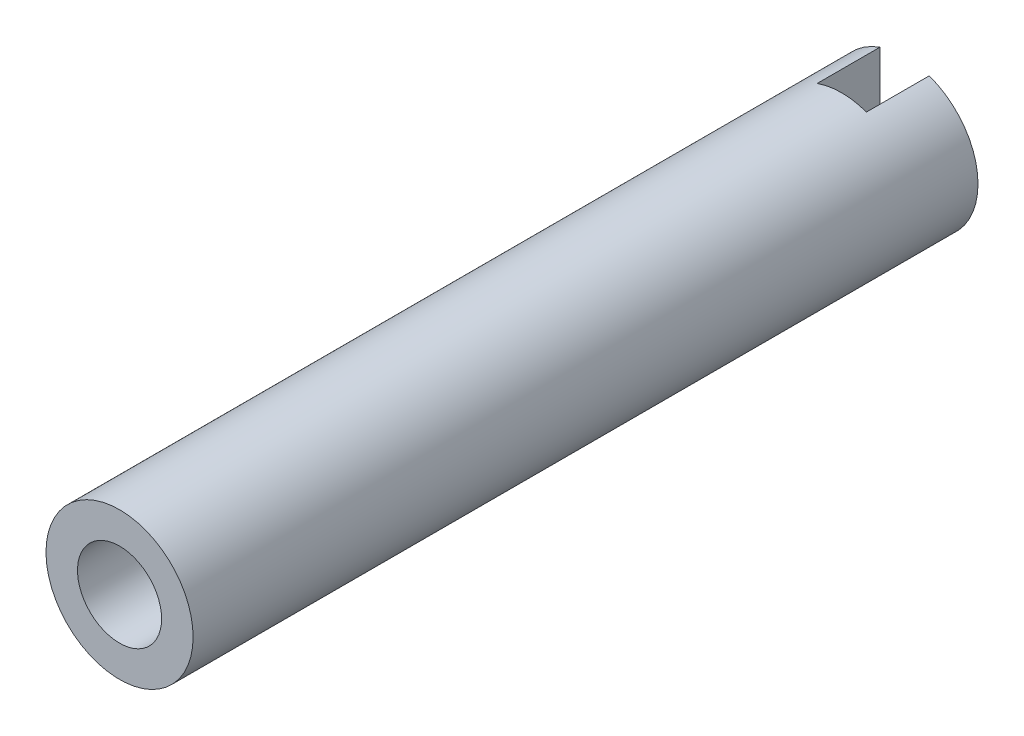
ISO-10303-21;
HEADER;
FILE_DESCRIPTION(('STEP AP214'),'2;1');
FILE_NAME('part.step','',(''),(''),'','','');
FILE_SCHEMA(('AUTOMOTIVE_DESIGN { 1 0 10303 214 1 1 1 1 }'));
ENDSEC;
DATA;
#1=APPLICATION_CONTEXT('core data for automotive mechanical design processes');
#2=APPLICATION_PROTOCOL_DEFINITION('international standard','automotive_design',2000,#1);
#3=PRODUCT_CONTEXT('',#1,'mechanical');
#4=PRODUCT('Part','Part','',(#3));
#5=PRODUCT_RELATED_PRODUCT_CATEGORY('part','',(#4));
#6=PRODUCT_DEFINITION_FORMATION('','',#4);
#7=PRODUCT_DEFINITION_CONTEXT('part definition',#1,'design');
#8=PRODUCT_DEFINITION('design','',#6,#7);
#9=PRODUCT_DEFINITION_SHAPE('','',#8);
#10=(LENGTH_UNIT() NAMED_UNIT(*) SI_UNIT(.MILLI.,.METRE.));
#11=(NAMED_UNIT(*) PLANE_ANGLE_UNIT() SI_UNIT($,.RADIAN.));
#12=(NAMED_UNIT(*) SI_UNIT($,.STERADIAN.) SOLID_ANGLE_UNIT());
#13=UNCERTAINTY_MEASURE_WITH_UNIT(LENGTH_MEASURE(1.E-05),#10,'distance_accuracy_value','');
#14=(GEOMETRIC_REPRESENTATION_CONTEXT(3) GLOBAL_UNCERTAINTY_ASSIGNED_CONTEXT((#13)) GLOBAL_UNIT_ASSIGNED_CONTEXT((#10,
#11,#12)) REPRESENTATION_CONTEXT('',''));
#15=CARTESIAN_POINT('',(0.,0.,0.));
#16=DIRECTION('',(0.,0.,1.));
#17=DIRECTION('',(1.,0.,0.));
#18=AXIS2_PLACEMENT_3D('',#15,#16,#17);
#19=CARTESIAN_POINT('',(0.,0.,0.));
#20=DIRECTION('',(0.,0.,1.));
#21=DIRECTION('',(1.,0.,0.));
#22=AXIS2_PLACEMENT_3D('',#19,#20,#21);
#23=PLANE('',#22);
#24=CARTESIAN_POINT('',(0.,0.,0.));
#25=DIRECTION('',(0.,0.,1.));
#26=DIRECTION('',(1.,0.,0.));
#27=AXIS2_PLACEMENT_3D('',#24,#25,#26);
#28=CIRCLE('',#27,2.0828);
#29=CARTESIAN_POINT('',(-0.694236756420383,1.96369324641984,0.));
#30=VERTEX_POINT('',#29);
#31=CARTESIAN_POINT('',(-0.694236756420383,-1.96369324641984,0.));
#32=VERTEX_POINT('',#31);
#33=EDGE_CURVE('E117',#30,#32,#28,.T.);
#34=ORIENTED_EDGE('',*,*,#33,.F.);
#35=DIRECTION('',(0.,-1.,0.));
#36=VECTOR('',#35,1.);
#37=CARTESIAN_POINT('',(-0.694236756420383,0.,0.));
#38=LINE('',#37,#36);
#39=EDGE_CURVE('E128',#30,#32,#38,.T.);
#40=ORIENTED_EDGE('',*,*,#39,.T.);
#41=EDGE_LOOP('',(#34,#40));
#42=FACE_BOUND('',#41,.T.);
#43=ADVANCED_FACE('F38',(#42),#23,.F.);
#44=CARTESIAN_POINT('',(0.,0.,22.225));
#45=DIRECTION('',(0.,0.,-1.));
#46=DIRECTION('',(-1.,0.,0.));
#47=AXIS2_PLACEMENT_3D('',#44,#45,#46);
#48=CYLINDRICAL_SURFACE('',#47,2.0828);
#49=CARTESIAN_POINT('',(0.,0.,1.778));
#50=DIRECTION('',(0.,0.,1.));
#51=DIRECTION('',(1.,0.,0.));
#52=AXIS2_PLACEMENT_3D('',#49,#50,#51);
#53=CIRCLE('',#52,2.0828);
#54=CARTESIAN_POINT('',(0.702763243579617,1.96065796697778,1.778));
#55=VERTEX_POINT('',#54);
#56=CARTESIAN_POINT('',(-0.694236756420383,1.96369324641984,1.778));
#57=VERTEX_POINT('',#56);
#58=EDGE_CURVE('E48',#55,#57,#53,.T.);
#59=ORIENTED_EDGE('',*,*,#58,.T.);
#60=DIRECTION('',(0.,0.,-1.));
#61=VECTOR('',#60,1.);
#62=CARTESIAN_POINT('',(-0.694236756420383,1.96369324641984,22.225));
#63=LINE('',#62,#61);
#64=EDGE_CURVE('E118',#57,#30,#63,.T.);
#65=ORIENTED_EDGE('',*,*,#64,.T.);
#66=ORIENTED_EDGE('',*,*,#33,.T.);
#67=DIRECTION('',(0.,0.,-1.));
#68=VECTOR('',#67,1.);
#69=CARTESIAN_POINT('',(-0.694236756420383,-1.96369324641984,22.225));
#70=LINE('',#69,#68);
#71=CARTESIAN_POINT('',(-0.694236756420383,-1.96369324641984,1.778));
#72=VERTEX_POINT('',#71);
#73=EDGE_CURVE('E123',#32,#72,#70,.F.);
#74=ORIENTED_EDGE('',*,*,#73,.T.);
#75=CARTESIAN_POINT('',(0.702763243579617,-1.96065796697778,1.778));
#76=VERTEX_POINT('',#75);
#77=EDGE_CURVE('E130',#72,#76,#53,.T.);
#78=ORIENTED_EDGE('',*,*,#77,.T.);
#79=DIRECTION('',(0.,0.,-1.));
#80=VECTOR('',#79,1.);
#81=CARTESIAN_POINT('',(0.702763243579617,-1.96065796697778,22.225));
#82=LINE('',#81,#80);
#83=CARTESIAN_POINT('',(0.702763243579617,-1.96065796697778,0.));
#84=VERTEX_POINT('',#83);
#85=EDGE_CURVE('E140',#76,#84,#82,.T.);
#86=ORIENTED_EDGE('',*,*,#85,.T.);
#87=CARTESIAN_POINT('',(0.702763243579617,1.96065796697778,0.));
#88=VERTEX_POINT('',#87);
#89=EDGE_CURVE('E116',#84,#88,#28,.T.);
#90=ORIENTED_EDGE('',*,*,#89,.T.);
#91=DIRECTION('',(0.,0.,-1.));
#92=VECTOR('',#91,1.);
#93=CARTESIAN_POINT('',(0.702763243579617,1.96065796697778,22.225));
#94=LINE('',#93,#92);
#95=EDGE_CURVE('E55',#88,#55,#94,.F.);
#96=ORIENTED_EDGE('',*,*,#95,.T.);
#97=EDGE_LOOP('',(#59,#65,#66,#74,#78,#86,#90,#96));
#98=FACE_BOUND('',#97,.T.);
#99=CARTESIAN_POINT('',(0.,0.,22.225));
#100=DIRECTION('',(0.,0.,1.));
#101=DIRECTION('',(1.,0.,0.));
#102=AXIS2_PLACEMENT_3D('',#99,#100,#101);
#103=CIRCLE('',#102,2.0828);
#104=CARTESIAN_POINT('',(2.0828,0.,22.225));
#105=VERTEX_POINT('',#104);
#106=EDGE_CURVE('E121',#105,#105,#103,.T.);
#107=ORIENTED_EDGE('',*,*,#106,.F.);
#108=EDGE_LOOP('',(#107));
#109=FACE_BOUND('',#108,.T.);
#110=ADVANCED_FACE('F92',(#98,#109),#48,.T.);
#111=CARTESIAN_POINT('',(0.,0.,22.225));
#112=DIRECTION('',(0.,0.,1.));
#113=DIRECTION('',(1.,0.,0.));
#114=AXIS2_PLACEMENT_3D('',#111,#112,#113);
#115=PLANE('',#114);
#116=CARTESIAN_POINT('',(0.,0.,22.225));
#117=DIRECTION('',(0.,0.,1.));
#118=DIRECTION('',(1.,0.,0.));
#119=AXIS2_PLACEMENT_3D('',#116,#117,#118);
#120=CIRCLE('',#119,1.190625);
#121=CARTESIAN_POINT('',(1.190625,0.,22.225));
#122=VERTEX_POINT('',#121);
#123=EDGE_CURVE('E143',#122,#122,#120,.T.);
#124=ORIENTED_EDGE('',*,*,#123,.F.);
#125=EDGE_LOOP('',(#124));
#126=FACE_BOUND('',#125,.T.);
#127=ORIENTED_EDGE('',*,*,#106,.T.);
#128=EDGE_LOOP('',(#127));
#129=FACE_BOUND('',#128,.T.);
#130=ADVANCED_FACE('F99',(#126,#129),#115,.T.);
#131=ORIENTED_EDGE('',*,*,#89,.F.);
#132=DIRECTION('',(0.,1.,0.));
#133=VECTOR('',#132,1.);
#134=CARTESIAN_POINT('',(0.702763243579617,0.,0.));
#135=LINE('',#134,#133);
#136=EDGE_CURVE('E76',#84,#88,#135,.T.);
#137=ORIENTED_EDGE('',*,*,#136,.T.);
#138=EDGE_LOOP('',(#131,#137));
#139=FACE_BOUND('',#138,.T.);
#140=ADVANCED_FACE('F95',(#139),#23,.F.);
#141=CARTESIAN_POINT('',(0.,0.,1.778));
#142=DIRECTION('',(0.,0.,1.));
#143=DIRECTION('',(1.,0.,0.));
#144=AXIS2_PLACEMENT_3D('',#141,#142,#143);
#145=PLANE('',#144);
#146=DIRECTION('',(0.,-1.,0.));
#147=VECTOR('',#146,1.);
#148=CARTESIAN_POINT('',(0.702763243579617,-2.15162347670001,1.778));
#149=LINE('',#148,#147);
#150=EDGE_CURVE('E137',#55,#76,#149,.T.);
#151=ORIENTED_EDGE('',*,*,#150,.T.);
#152=ORIENTED_EDGE('',*,*,#77,.F.);
#153=DIRECTION('',(0.,1.,0.));
#154=VECTOR('',#153,1.);
#155=CARTESIAN_POINT('',(-0.694236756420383,-2.15162347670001,1.778));
#156=LINE('',#155,#154);
#157=EDGE_CURVE('E139',#72,#57,#156,.T.);
#158=ORIENTED_EDGE('',*,*,#157,.T.);
#159=ORIENTED_EDGE('',*,*,#58,.F.);
#160=EDGE_LOOP('',(#151,#152,#158,#159));
#161=FACE_BOUND('',#160,.T.);
#162=ADVANCED_FACE('F104',(#161),#145,.F.);
#163=CARTESIAN_POINT('',(-0.694236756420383,-2.15162347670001,1.778));
#164=DIRECTION('',(-1.,0.,0.));
#165=DIRECTION('',(0.,0.,1.));
#166=AXIS2_PLACEMENT_3D('',#163,#164,#165);
#167=PLANE('',#166);
#168=ORIENTED_EDGE('',*,*,#157,.F.);
#169=ORIENTED_EDGE('',*,*,#73,.F.);
#170=ORIENTED_EDGE('',*,*,#39,.F.);
#171=ORIENTED_EDGE('',*,*,#64,.F.);
#172=EDGE_LOOP('',(#168,#169,#170,#171));
#173=FACE_BOUND('',#172,.T.);
#174=ADVANCED_FACE('F110',(#173),#167,.F.);
#175=CARTESIAN_POINT('',(0.702763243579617,-2.15162347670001,1.778));
#176=DIRECTION('',(1.,0.,0.));
#177=DIRECTION('',(0.,0.,-1.));
#178=AXIS2_PLACEMENT_3D('',#175,#176,#177);
#179=PLANE('',#178);
#180=ORIENTED_EDGE('',*,*,#150,.F.);
#181=ORIENTED_EDGE('',*,*,#95,.F.);
#182=ORIENTED_EDGE('',*,*,#136,.F.);
#183=ORIENTED_EDGE('',*,*,#85,.F.);
#184=EDGE_LOOP('',(#180,#181,#182,#183));
#185=FACE_BOUND('',#184,.T.);
#186=ADVANCED_FACE('F87',(#185),#179,.F.);
#187=CARTESIAN_POINT('',(0.,0.,19.05));
#188=DIRECTION('',(0.,0.,1.));
#189=DIRECTION('',(1.,0.,0.));
#190=AXIS2_PLACEMENT_3D('',#187,#188,#189);
#191=CYLINDRICAL_SURFACE('',#190,1.190625);
#192=CARTESIAN_POINT('',(0.,0.,20.240625));
#193=DIRECTION('',(0.,0.,1.));
#194=DIRECTION('',(1.,0.,0.));
#195=AXIS2_PLACEMENT_3D('',#192,#193,#194);
#196=CIRCLE('',#195,1.190625);
#197=CARTESIAN_POINT('',(1.190625,0.,20.240625));
#198=VERTEX_POINT('',#197);
#199=EDGE_CURVE('E11',#198,#198,#196,.F.);
#200=ORIENTED_EDGE('',*,*,#199,.T.);
#201=EDGE_LOOP('',(#200));
#202=FACE_BOUND('',#201,.T.);
#203=ORIENTED_EDGE('',*,*,#123,.T.);
#204=EDGE_LOOP('',(#203));
#205=FACE_BOUND('',#204,.T.);
#206=ADVANCED_FACE('F81',(#202,#205),#191,.F.);
#207=CARTESIAN_POINT('',(0.,0.,20.240625));
#208=DIRECTION('',(0.,0.,1.));
#209=DIRECTION('',(1.,0.,0.));
#210=AXIS2_PLACEMENT_3D('',#207,#208,#209);
#211=CONICAL_SURFACE('',#210,1.190625,0.785398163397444);
#212=ORIENTED_EDGE('',*,*,#199,.F.);
#213=EDGE_LOOP('',(#212));
#214=FACE_BOUND('',#213,.T.);
#215=CARTESIAN_POINT('',(0.,0.,19.05));
#216=VERTEX_POINT('',#215);
#217=VERTEX_LOOP('',#216);
#218=FACE_BOUND('',#217,.T.);
#219=ADVANCED_FACE('F41',(#214,#218),#211,.F.);
#220=CLOSED_SHELL('',(#43,#110,#130,#140,#162,#174,#186,#206,#219));
#221=MANIFOLD_SOLID_BREP('B2',#220);
#222=ADVANCED_BREP_SHAPE_REPRESENTATION('',(#18,#221),#14);
#223=SHAPE_DEFINITION_REPRESENTATION(#9,#222);
ENDSEC;
END-ISO-10303-21;
